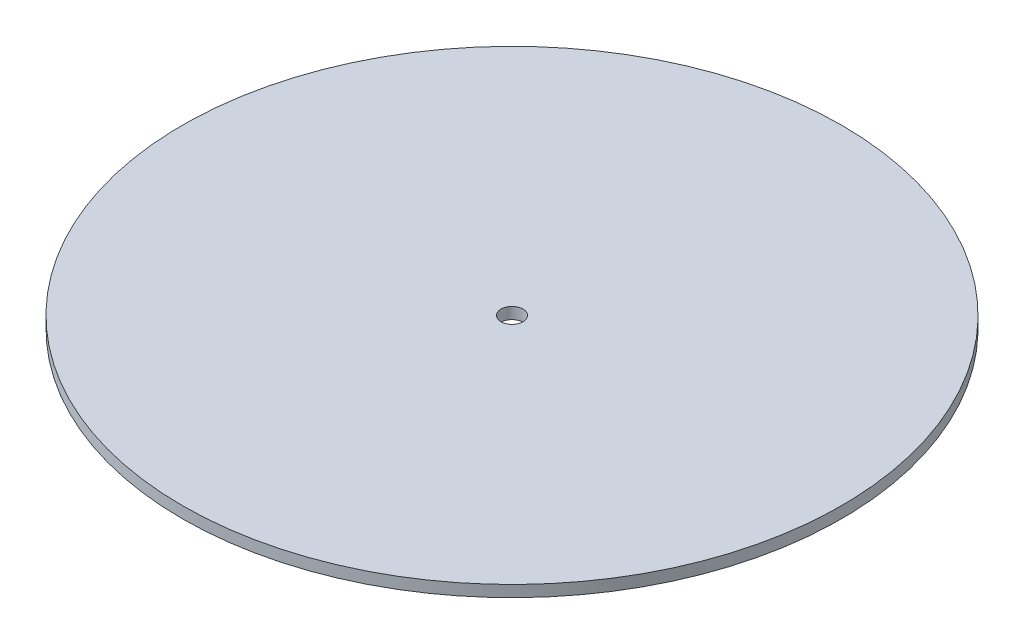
ISO-10303-21;
HEADER;
FILE_DESCRIPTION(('STEP AP214'),'2;1');
FILE_NAME('part.step','',(''),(''),'','','');
FILE_SCHEMA(('AUTOMOTIVE_DESIGN { 1 0 10303 214 1 1 1 1 }'));
ENDSEC;
DATA;
#1=APPLICATION_CONTEXT('core data for automotive mechanical design processes');
#2=APPLICATION_PROTOCOL_DEFINITION('international standard','automotive_design',2000,#1);
#3=PRODUCT_CONTEXT('',#1,'mechanical');
#4=PRODUCT('Part','Part','',(#3));
#5=PRODUCT_RELATED_PRODUCT_CATEGORY('part','',(#4));
#6=PRODUCT_DEFINITION_FORMATION('','',#4);
#7=PRODUCT_DEFINITION_CONTEXT('part definition',#1,'design');
#8=PRODUCT_DEFINITION('design','',#6,#7);
#9=PRODUCT_DEFINITION_SHAPE('','',#8);
#10=(LENGTH_UNIT() NAMED_UNIT(*) SI_UNIT(.MILLI.,.METRE.));
#11=(NAMED_UNIT(*) PLANE_ANGLE_UNIT() SI_UNIT($,.RADIAN.));
#12=(NAMED_UNIT(*) SI_UNIT($,.STERADIAN.) SOLID_ANGLE_UNIT());
#13=UNCERTAINTY_MEASURE_WITH_UNIT(LENGTH_MEASURE(1.E-05),#10,'distance_accuracy_value','');
#14=(GEOMETRIC_REPRESENTATION_CONTEXT(3) GLOBAL_UNCERTAINTY_ASSIGNED_CONTEXT((#13)) GLOBAL_UNIT_ASSIGNED_CONTEXT((#10,
#11,#12)) REPRESENTATION_CONTEXT('',''));
#15=CARTESIAN_POINT('',(0.,0.,0.));
#16=DIRECTION('',(0.,0.,1.));
#17=DIRECTION('',(1.,0.,0.));
#18=AXIS2_PLACEMENT_3D('',#15,#16,#17);
#19=CARTESIAN_POINT('',(0.,3.302,0.));
#20=DIRECTION('',(0.,1.,0.));
#21=DIRECTION('',(0.,0.,1.));
#22=AXIS2_PLACEMENT_3D('',#19,#20,#21);
#23=PLANE('',#22);
#24=CARTESIAN_POINT('',(0.,3.302,0.));
#25=DIRECTION('',(0.,1.,0.));
#26=DIRECTION('',(0.,0.,1.));
#27=AXIS2_PLACEMENT_3D('',#24,#25,#26);
#28=CIRCLE('',#27,95.25);
#29=CARTESIAN_POINT('',(0.,3.302,-95.25));
#30=VERTEX_POINT('',#29);
#31=EDGE_CURVE('E10',#30,#30,#28,.T.);
#32=ORIENTED_EDGE('',*,*,#31,.T.);
#33=EDGE_LOOP('',(#32));
#34=FACE_BOUND('',#33,.T.);
#35=CARTESIAN_POINT('',(0.,3.302,0.));
#36=DIRECTION('',(0.,1.,0.));
#37=DIRECTION('',(0.,0.,1.));
#38=AXIS2_PLACEMENT_3D('',#35,#36,#37);
#39=CIRCLE('',#38,3.175);
#40=CARTESIAN_POINT('',(0.,3.302,-3.175));
#41=VERTEX_POINT('',#40);
#42=EDGE_CURVE('E52',#41,#41,#39,.T.);
#43=ORIENTED_EDGE('',*,*,#42,.F.);
#44=EDGE_LOOP('',(#43));
#45=FACE_BOUND('',#44,.T.);
#46=ADVANCED_FACE('F39',(#34,#45),#23,.T.);
#47=CARTESIAN_POINT('',(0.,0.,0.));
#48=DIRECTION('',(0.,1.,0.));
#49=DIRECTION('',(0.,0.,1.));
#50=AXIS2_PLACEMENT_3D('',#47,#48,#49);
#51=PLANE('',#50);
#52=CARTESIAN_POINT('',(0.,0.,0.));
#53=DIRECTION('',(0.,1.,0.));
#54=DIRECTION('',(0.,0.,1.));
#55=AXIS2_PLACEMENT_3D('',#52,#53,#54);
#56=CIRCLE('',#55,95.25);
#57=CARTESIAN_POINT('',(0.,0.,-95.25));
#58=VERTEX_POINT('',#57);
#59=EDGE_CURVE('E43',#58,#58,#56,.T.);
#60=ORIENTED_EDGE('',*,*,#59,.F.);
#61=EDGE_LOOP('',(#60));
#62=FACE_BOUND('',#61,.T.);
#63=CARTESIAN_POINT('',(0.,0.,0.));
#64=DIRECTION('',(0.,1.,0.));
#65=DIRECTION('',(0.,0.,1.));
#66=AXIS2_PLACEMENT_3D('',#63,#64,#65);
#67=CIRCLE('',#66,3.175);
#68=CARTESIAN_POINT('',(0.,0.,-3.175));
#69=VERTEX_POINT('',#68);
#70=EDGE_CURVE('E54',#69,#69,#67,.T.);
#71=ORIENTED_EDGE('',*,*,#70,.T.);
#72=EDGE_LOOP('',(#71));
#73=FACE_BOUND('',#72,.T.);
#74=ADVANCED_FACE('F66',(#62,#73),#51,.F.);
#75=CARTESIAN_POINT('',(0.,3.302,0.));
#76=DIRECTION('',(0.,-1.,0.));
#77=DIRECTION('',(0.,0.,-1.));
#78=AXIS2_PLACEMENT_3D('',#75,#76,#77);
#79=CYLINDRICAL_SURFACE('',#78,95.25);
#80=CARTESIAN_POINT('',(0.,3.302,-95.25));
#81=CARTESIAN_POINT('',(0.,3.26760416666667,-95.25));
#82=CARTESIAN_POINT('',(0.,3.23320833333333,-95.25));
#83=CARTESIAN_POINT('',(0.,3.16441666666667,-95.25));
#84=CARTESIAN_POINT('',(0.,3.13002083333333,-95.25));
#85=CARTESIAN_POINT('',(0.,3.06122916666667,-95.25));
#86=CARTESIAN_POINT('',(0.,3.02683333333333,-95.25));
#87=CARTESIAN_POINT('',(0.,2.95804166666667,-95.25));
#88=CARTESIAN_POINT('',(0.,2.92364583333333,-95.25));
#89=CARTESIAN_POINT('',(0.,2.85485416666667,-95.25));
#90=CARTESIAN_POINT('',(0.,2.82045833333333,-95.25));
#91=CARTESIAN_POINT('',(0.,2.75166666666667,-95.25));
#92=CARTESIAN_POINT('',(0.,2.71727083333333,-95.25));
#93=CARTESIAN_POINT('',(0.,2.64847916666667,-95.25));
#94=CARTESIAN_POINT('',(0.,2.61408333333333,-95.25));
#95=CARTESIAN_POINT('',(0.,2.54529166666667,-95.25));
#96=CARTESIAN_POINT('',(0.,2.51089583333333,-95.25));
#97=CARTESIAN_POINT('',(0.,2.44210416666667,-95.25));
#98=CARTESIAN_POINT('',(0.,2.40770833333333,-95.25));
#99=CARTESIAN_POINT('',(0.,2.33891666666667,-95.25));
#100=CARTESIAN_POINT('',(0.,2.30452083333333,-95.25));
#101=CARTESIAN_POINT('',(0.,2.23572916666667,-95.25));
#102=CARTESIAN_POINT('',(0.,2.20133333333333,-95.25));
#103=CARTESIAN_POINT('',(0.,2.13254166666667,-95.25));
#104=CARTESIAN_POINT('',(0.,2.09814583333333,-95.25));
#105=CARTESIAN_POINT('',(0.,2.02935416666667,-95.25));
#106=CARTESIAN_POINT('',(0.,1.99495833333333,-95.25));
#107=CARTESIAN_POINT('',(0.,1.92616666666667,-95.25));
#108=CARTESIAN_POINT('',(0.,1.89177083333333,-95.25));
#109=CARTESIAN_POINT('',(0.,1.82297916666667,-95.25));
#110=CARTESIAN_POINT('',(0.,1.78858333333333,-95.25));
#111=CARTESIAN_POINT('',(0.,1.71979166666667,-95.25));
#112=CARTESIAN_POINT('',(0.,1.68539583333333,-95.25));
#113=CARTESIAN_POINT('',(0.,1.61660416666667,-95.25));
#114=CARTESIAN_POINT('',(0.,1.58220833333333,-95.25));
#115=CARTESIAN_POINT('',(0.,1.51341666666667,-95.25));
#116=CARTESIAN_POINT('',(0.,1.47902083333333,-95.25));
#117=CARTESIAN_POINT('',(0.,1.41022916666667,-95.25));
#118=CARTESIAN_POINT('',(0.,1.37583333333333,-95.25));
#119=CARTESIAN_POINT('',(0.,1.30704166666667,-95.25));
#120=CARTESIAN_POINT('',(0.,1.27264583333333,-95.25));
#121=CARTESIAN_POINT('',(0.,1.20385416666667,-95.25));
#122=CARTESIAN_POINT('',(0.,1.16945833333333,-95.25));
#123=CARTESIAN_POINT('',(0.,1.10066666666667,-95.25));
#124=CARTESIAN_POINT('',(0.,1.06627083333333,-95.25));
#125=CARTESIAN_POINT('',(0.,0.997479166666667,-95.25));
#126=CARTESIAN_POINT('',(0.,0.963083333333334,-95.25));
#127=CARTESIAN_POINT('',(0.,0.894291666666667,-95.25));
#128=CARTESIAN_POINT('',(0.,0.859895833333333,-95.25));
#129=CARTESIAN_POINT('',(0.,0.791104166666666,-95.25));
#130=CARTESIAN_POINT('',(0.,0.756708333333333,-95.25));
#131=CARTESIAN_POINT('',(0.,0.687916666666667,-95.25));
#132=CARTESIAN_POINT('',(0.,0.653520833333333,-95.25));
#133=CARTESIAN_POINT('',(0.,0.584729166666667,-95.25));
#134=CARTESIAN_POINT('',(0.,0.550333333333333,-95.25));
#135=CARTESIAN_POINT('',(0.,0.481541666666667,-95.25));
#136=CARTESIAN_POINT('',(0.,0.447145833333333,-95.25));
#137=CARTESIAN_POINT('',(0.,0.378354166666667,-95.25));
#138=CARTESIAN_POINT('',(0.,0.343958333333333,-95.25));
#139=CARTESIAN_POINT('',(0.,0.275166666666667,-95.25));
#140=CARTESIAN_POINT('',(0.,0.240770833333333,-95.25));
#141=CARTESIAN_POINT('',(0.,0.171979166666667,-95.25));
#142=CARTESIAN_POINT('',(0.,0.137583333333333,-95.25));
#143=CARTESIAN_POINT('',(0.,0.0687916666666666,-95.25));
#144=CARTESIAN_POINT('',(0.,0.0343958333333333,-95.25));
#145=CARTESIAN_POINT('',(0.,0.,-95.25));
#146=B_SPLINE_CURVE_WITH_KNOTS('',3,(#80,#81,#82,#83,#84,#85,#86,#87,#88,#89,#90,#91,#92,#93,
#94,#95,#96,#97,#98,#99,#100,#101,#102,#103,#104,#105,#106,#107,#108,#109,#110,#111,#112,#113,
#114,#115,#116,#117,#118,#119,#120,#121,#122,#123,#124,#125,#126,#127,#128,#129,#130,#131,#132,
#133,#134,#135,#136,#137,#138,#139,#140,#141,#142,#143,#144,#145),.UNSPECIFIED.,.F.,.F.,(4,2,2,
2,2,2,2,2,2,2,2,2,2,2,2,2,2,2,2,2,2,2,2,2,2,2,2,2,2,2,2,2,4),(0.,0.1031875,0.206375,0.3095625,
0.41275,0.5159375,0.619125,0.7223125,0.8255,0.9286875,1.031875,1.1350625,1.23825,1.3414375,
1.444625,1.5478125,1.651,1.7541875,1.857375,1.9605625,2.06375,2.1669375,2.270125,2.3733125,
2.4765,2.5796875,2.682875,2.7860625,2.88925,2.9924375,3.095625,3.1988125,3.302),.UNSPECIFIED.);
#147=EDGE_CURVE('BSEAM41',#30,#58,#146,.T.);
#148=ORIENTED_EDGE('',*,*,#31,.F.);
#149=ORIENTED_EDGE('',*,*,#59,.T.);
#150=ORIENTED_EDGE('',*,*,#147,.T.);
#151=ORIENTED_EDGE('',*,*,#147,.F.);
#152=EDGE_LOOP('',(#148,#150,#149,#151));
#153=FACE_BOUND('',#152,.T.);
#154=ADVANCED_FACE('F41',(#153),#79,.T.);
#155=CARTESIAN_POINT('',(0.,3.302,0.));
#156=DIRECTION('',(0.,-1.,0.));
#157=DIRECTION('',(0.,0.,-1.));
#158=AXIS2_PLACEMENT_3D('',#155,#156,#157);
#159=CYLINDRICAL_SURFACE('',#158,3.175);
#160=CARTESIAN_POINT('',(0.,3.302,-3.175));
#161=CARTESIAN_POINT('',(0.,3.26760416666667,-3.175));
#162=CARTESIAN_POINT('',(0.,3.23320833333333,-3.175));
#163=CARTESIAN_POINT('',(0.,3.16441666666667,-3.175));
#164=CARTESIAN_POINT('',(0.,3.13002083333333,-3.175));
#165=CARTESIAN_POINT('',(0.,3.06122916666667,-3.175));
#166=CARTESIAN_POINT('',(0.,3.02683333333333,-3.175));
#167=CARTESIAN_POINT('',(0.,2.95804166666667,-3.175));
#168=CARTESIAN_POINT('',(0.,2.92364583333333,-3.175));
#169=CARTESIAN_POINT('',(0.,2.85485416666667,-3.175));
#170=CARTESIAN_POINT('',(0.,2.82045833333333,-3.175));
#171=CARTESIAN_POINT('',(0.,2.75166666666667,-3.175));
#172=CARTESIAN_POINT('',(0.,2.71727083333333,-3.175));
#173=CARTESIAN_POINT('',(0.,2.64847916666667,-3.175));
#174=CARTESIAN_POINT('',(0.,2.61408333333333,-3.175));
#175=CARTESIAN_POINT('',(0.,2.54529166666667,-3.175));
#176=CARTESIAN_POINT('',(0.,2.51089583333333,-3.175));
#177=CARTESIAN_POINT('',(0.,2.44210416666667,-3.175));
#178=CARTESIAN_POINT('',(0.,2.40770833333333,-3.175));
#179=CARTESIAN_POINT('',(0.,2.33891666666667,-3.175));
#180=CARTESIAN_POINT('',(0.,2.30452083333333,-3.175));
#181=CARTESIAN_POINT('',(0.,2.23572916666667,-3.175));
#182=CARTESIAN_POINT('',(0.,2.20133333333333,-3.175));
#183=CARTESIAN_POINT('',(0.,2.13254166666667,-3.175));
#184=CARTESIAN_POINT('',(0.,2.09814583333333,-3.175));
#185=CARTESIAN_POINT('',(0.,2.02935416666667,-3.175));
#186=CARTESIAN_POINT('',(0.,1.99495833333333,-3.175));
#187=CARTESIAN_POINT('',(0.,1.92616666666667,-3.175));
#188=CARTESIAN_POINT('',(0.,1.89177083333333,-3.175));
#189=CARTESIAN_POINT('',(0.,1.82297916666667,-3.175));
#190=CARTESIAN_POINT('',(0.,1.78858333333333,-3.175));
#191=CARTESIAN_POINT('',(0.,1.71979166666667,-3.175));
#192=CARTESIAN_POINT('',(0.,1.68539583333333,-3.175));
#193=CARTESIAN_POINT('',(0.,1.61660416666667,-3.175));
#194=CARTESIAN_POINT('',(0.,1.58220833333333,-3.175));
#195=CARTESIAN_POINT('',(0.,1.51341666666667,-3.175));
#196=CARTESIAN_POINT('',(0.,1.47902083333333,-3.175));
#197=CARTESIAN_POINT('',(0.,1.41022916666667,-3.175));
#198=CARTESIAN_POINT('',(0.,1.37583333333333,-3.175));
#199=CARTESIAN_POINT('',(0.,1.30704166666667,-3.175));
#200=CARTESIAN_POINT('',(0.,1.27264583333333,-3.175));
#201=CARTESIAN_POINT('',(0.,1.20385416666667,-3.175));
#202=CARTESIAN_POINT('',(0.,1.16945833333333,-3.175));
#203=CARTESIAN_POINT('',(0.,1.10066666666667,-3.175));
#204=CARTESIAN_POINT('',(0.,1.06627083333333,-3.175));
#205=CARTESIAN_POINT('',(0.,0.997479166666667,-3.175));
#206=CARTESIAN_POINT('',(0.,0.963083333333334,-3.175));
#207=CARTESIAN_POINT('',(0.,0.894291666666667,-3.175));
#208=CARTESIAN_POINT('',(0.,0.859895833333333,-3.175));
#209=CARTESIAN_POINT('',(0.,0.791104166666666,-3.175));
#210=CARTESIAN_POINT('',(0.,0.756708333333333,-3.175));
#211=CARTESIAN_POINT('',(0.,0.687916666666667,-3.175));
#212=CARTESIAN_POINT('',(0.,0.653520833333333,-3.175));
#213=CARTESIAN_POINT('',(0.,0.584729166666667,-3.175));
#214=CARTESIAN_POINT('',(0.,0.550333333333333,-3.175));
#215=CARTESIAN_POINT('',(0.,0.481541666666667,-3.175));
#216=CARTESIAN_POINT('',(0.,0.447145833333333,-3.175));
#217=CARTESIAN_POINT('',(0.,0.378354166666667,-3.175));
#218=CARTESIAN_POINT('',(0.,0.343958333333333,-3.175));
#219=CARTESIAN_POINT('',(0.,0.275166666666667,-3.175));
#220=CARTESIAN_POINT('',(0.,0.240770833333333,-3.175));
#221=CARTESIAN_POINT('',(0.,0.171979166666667,-3.175));
#222=CARTESIAN_POINT('',(0.,0.137583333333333,-3.175));
#223=CARTESIAN_POINT('',(0.,0.0687916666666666,-3.175));
#224=CARTESIAN_POINT('',(0.,0.0343958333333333,-3.175));
#225=CARTESIAN_POINT('',(0.,0.,-3.175));
#226=B_SPLINE_CURVE_WITH_KNOTS('',3,(#160,#161,#162,#163,#164,#165,#166,#167,#168,#169,#170,
#171,#172,#173,#174,#175,#176,#177,#178,#179,#180,#181,#182,#183,#184,#185,#186,#187,#188,#189,
#190,#191,#192,#193,#194,#195,#196,#197,#198,#199,#200,#201,#202,#203,#204,#205,#206,#207,#208,
#209,#210,#211,#212,#213,#214,#215,#216,#217,#218,#219,#220,#221,#222,#223,#224,#225),
.UNSPECIFIED.,.F.,.F.,(4,2,2,2,2,2,2,2,2,2,2,2,2,2,2,2,2,2,2,2,2,2,2,2,2,2,2,2,2,2,2,2,4),(0.,
0.1031875,0.206375,0.3095625,0.41275,0.5159375,0.619125,0.7223125,0.8255,0.9286875,1.031875,
1.1350625,1.23825,1.3414375,1.444625,1.5478125,1.651,1.7541875,1.857375,1.9605625,2.06375,
2.1669375,2.270125,2.3733125,2.4765,2.5796875,2.682875,2.7860625,2.88925,2.9924375,3.095625,
3.1988125,3.302),.UNSPECIFIED.);
#227=EDGE_CURVE('BSEAM62',#41,#69,#226,.T.);
#228=ORIENTED_EDGE('',*,*,#42,.T.);
#229=ORIENTED_EDGE('',*,*,#70,.F.);
#230=ORIENTED_EDGE('',*,*,#227,.T.);
#231=ORIENTED_EDGE('',*,*,#227,.F.);
#232=EDGE_LOOP('',(#228,#230,#229,#231));
#233=FACE_BOUND('',#232,.T.);
#234=ADVANCED_FACE('F62',(#233),#159,.F.);
#235=CLOSED_SHELL('',(#46,#74,#154,#234));
#236=MANIFOLD_SOLID_BREP('B2',#235);
#237=ADVANCED_BREP_SHAPE_REPRESENTATION('',(#18,#236),#14);
#238=SHAPE_DEFINITION_REPRESENTATION(#9,#237);
ENDSEC;
END-ISO-10303-21;
